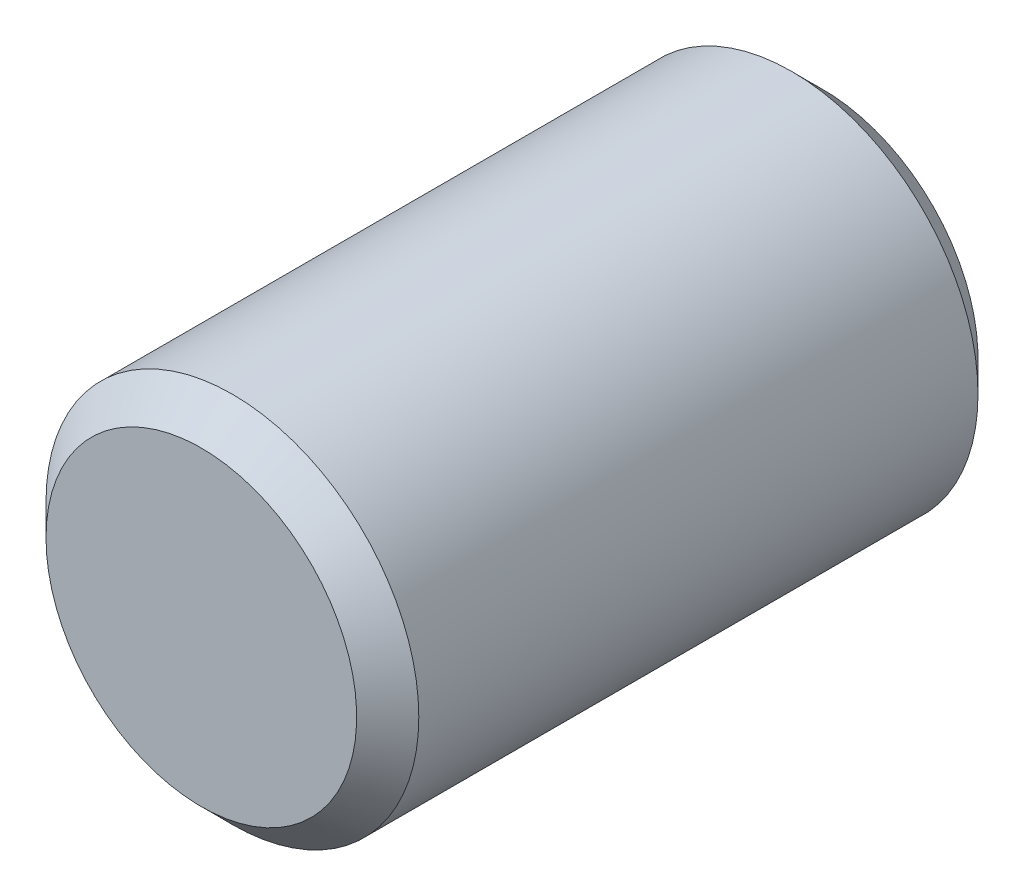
ISO-10303-21;
HEADER;
FILE_DESCRIPTION(('STEP AP214'),'2;1');
FILE_NAME('part.step','',(''),(''),'','','');
FILE_SCHEMA(('AUTOMOTIVE_DESIGN { 1 0 10303 214 1 1 1 1 }'));
ENDSEC;
DATA;
#1=APPLICATION_CONTEXT('core data for automotive mechanical design processes');
#2=APPLICATION_PROTOCOL_DEFINITION('international standard','automotive_design',2000,#1);
#3=PRODUCT_CONTEXT('',#1,'mechanical');
#4=PRODUCT('Part','Part','',(#3));
#5=PRODUCT_RELATED_PRODUCT_CATEGORY('part','',(#4));
#6=PRODUCT_DEFINITION_FORMATION('','',#4);
#7=PRODUCT_DEFINITION_CONTEXT('part definition',#1,'design');
#8=PRODUCT_DEFINITION('design','',#6,#7);
#9=PRODUCT_DEFINITION_SHAPE('','',#8);
#10=(LENGTH_UNIT() NAMED_UNIT(*) SI_UNIT(.MILLI.,.METRE.));
#11=(NAMED_UNIT(*) PLANE_ANGLE_UNIT() SI_UNIT($,.RADIAN.));
#12=(NAMED_UNIT(*) SI_UNIT($,.STERADIAN.) SOLID_ANGLE_UNIT());
#13=UNCERTAINTY_MEASURE_WITH_UNIT(LENGTH_MEASURE(1.E-05),#10,'distance_accuracy_value','');
#14=(GEOMETRIC_REPRESENTATION_CONTEXT(3) GLOBAL_UNCERTAINTY_ASSIGNED_CONTEXT((#13)) GLOBAL_UNIT_ASSIGNED_CONTEXT((#10,
#11,#12)) REPRESENTATION_CONTEXT('',''));
#15=CARTESIAN_POINT('',(0.,0.,0.));
#16=DIRECTION('',(0.,0.,1.));
#17=DIRECTION('',(1.,0.,0.));
#18=AXIS2_PLACEMENT_3D('',#15,#16,#17);
#19=CARTESIAN_POINT('',(0.,0.,0.));
#20=DIRECTION('',(0.,0.,-1.));
#21=DIRECTION('',(-1.,0.,0.));
#22=AXIS2_PLACEMENT_3D('',#19,#20,#21);
#23=PLANE('',#22);
#24=CARTESIAN_POINT('',(0.,0.,0.));
#25=DIRECTION('',(0.,0.,-1.));
#26=DIRECTION('',(-1.,0.,0.));
#27=AXIS2_PLACEMENT_3D('',#24,#25,#26);
#28=CIRCLE('',#27,2.5);
#29=CARTESIAN_POINT('',(-2.5,0.,0.));
#30=VERTEX_POINT('',#29);
#31=EDGE_CURVE('E11',#30,#30,#28,.T.);
#32=ORIENTED_EDGE('',*,*,#31,.T.);
#33=EDGE_LOOP('',(#32));
#34=FACE_BOUND('',#33,.T.);
#35=DIRECTION('',(0.866025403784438,-0.500000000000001,0.));
#36=VECTOR('',#35,1.);
#37=CARTESIAN_POINT('',(0.,1.72,0.));
#38=LINE('',#37,#36);
#39=CARTESIAN_POINT('',(0.,1.72,0.));
#40=VERTEX_POINT('',#39);
#41=CARTESIAN_POINT('',(1.48956369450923,0.86,0.));
#42=VERTEX_POINT('',#41);
#43=EDGE_CURVE('E501',#40,#42,#38,.T.);
#44=ORIENTED_EDGE('',*,*,#43,.F.);
#45=DIRECTION('',(-0.866025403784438,-0.500000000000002,0.));
#46=VECTOR('',#45,1.);
#47=CARTESIAN_POINT('',(0.,1.72,0.));
#48=LINE('',#47,#46);
#49=CARTESIAN_POINT('',(-1.48956369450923,0.859999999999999,0.));
#50=VERTEX_POINT('',#49);
#51=EDGE_CURVE('E446',#40,#50,#48,.T.);
#52=ORIENTED_EDGE('',*,*,#51,.T.);
#53=DIRECTION('',(0.,-1.,0.));
#54=VECTOR('',#53,1.);
#55=CARTESIAN_POINT('',(-1.48956369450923,0.859999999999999,0.));
#56=LINE('',#55,#54);
#57=CARTESIAN_POINT('',(-1.48956369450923,-0.86,0.));
#58=VERTEX_POINT('',#57);
#59=EDGE_CURVE('E484',#50,#58,#56,.T.);
#60=ORIENTED_EDGE('',*,*,#59,.T.);
#61=DIRECTION('',(0.866025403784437,-0.500000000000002,0.));
#62=VECTOR('',#61,1.);
#63=CARTESIAN_POINT('',(-1.48956369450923,-0.86,0.));
#64=LINE('',#63,#62);
#65=CARTESIAN_POINT('',(0.,-1.72,0.));
#66=VERTEX_POINT('',#65);
#67=EDGE_CURVE('E492',#58,#66,#64,.T.);
#68=ORIENTED_EDGE('',*,*,#67,.T.);
#69=DIRECTION('',(-0.866025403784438,-0.5,0.));
#70=VECTOR('',#69,1.);
#71=CARTESIAN_POINT('',(1.48956369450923,-0.859999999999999,0.));
#72=LINE('',#71,#70);
#73=CARTESIAN_POINT('',(1.48956369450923,-0.859999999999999,0.));
#74=VERTEX_POINT('',#73);
#75=EDGE_CURVE('E505',#74,#66,#72,.T.);
#76=ORIENTED_EDGE('',*,*,#75,.F.);
#77=DIRECTION('',(0.,-1.,0.));
#78=VECTOR('',#77,1.);
#79=CARTESIAN_POINT('',(1.48956369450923,0.86,0.));
#80=LINE('',#79,#78);
#81=EDGE_CURVE('E508',#42,#74,#80,.T.);
#82=ORIENTED_EDGE('',*,*,#81,.F.);
#83=EDGE_LOOP('',(#44,#52,#60,#68,#76,#82));
#84=FACE_BOUND('',#83,.T.);
#85=ADVANCED_FACE('F432',(#34,#84),#23,.T.);
#86=CARTESIAN_POINT('',(0.,0.,0.));
#87=DIRECTION('',(0.,0.,1.));
#88=DIRECTION('',(1.,0.,0.));
#89=AXIS2_PLACEMENT_3D('',#86,#87,#88);
#90=CONICAL_SURFACE('',#89,2.5,0.785398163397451);
#91=CARTESIAN_POINT('',(0.,0.,0.499999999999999));
#92=DIRECTION('',(0.,0.,-1.));
#93=DIRECTION('',(-1.,0.,0.));
#94=AXIS2_PLACEMENT_3D('',#91,#92,#93);
#95=CIRCLE('',#94,3.);
#96=CARTESIAN_POINT('',(-3.,0.,0.499999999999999));
#97=VERTEX_POINT('',#96);
#98=EDGE_CURVE('E439',#97,#97,#95,.T.);
#99=ORIENTED_EDGE('',*,*,#98,.T.);
#100=EDGE_LOOP('',(#99));
#101=FACE_BOUND('',#100,.T.);
#102=ORIENTED_EDGE('',*,*,#31,.F.);
#103=EDGE_LOOP('',(#102));
#104=FACE_BOUND('',#103,.T.);
#105=ADVANCED_FACE('F541',(#101,#104),#90,.T.);
#106=CARTESIAN_POINT('',(0.,0.,-10.));
#107=DIRECTION('',(0.,0.,-1.));
#108=DIRECTION('',(-1.,0.,0.));
#109=AXIS2_PLACEMENT_3D('',#106,#107,#108);
#110=CYLINDRICAL_SURFACE('',#109,3.);
#111=CARTESIAN_POINT('',(0.,0.,9.5));
#112=DIRECTION('',(0.,0.,-1.));
#113=DIRECTION('',(-1.,0.,0.));
#114=AXIS2_PLACEMENT_3D('',#111,#112,#113);
#115=CIRCLE('',#114,3.);
#116=CARTESIAN_POINT('',(-3.,0.,9.5));
#117=VERTEX_POINT('',#116);
#118=EDGE_CURVE('E536',#117,#117,#115,.T.);
#119=ORIENTED_EDGE('',*,*,#118,.T.);
#120=EDGE_LOOP('',(#119));
#121=FACE_BOUND('',#120,.T.);
#122=ORIENTED_EDGE('',*,*,#98,.F.);
#123=EDGE_LOOP('',(#122));
#124=FACE_BOUND('',#123,.T.);
#125=ADVANCED_FACE('F544',(#121,#124),#110,.T.);
#126=CARTESIAN_POINT('',(0.,0.,9.5));
#127=DIRECTION('',(0.,0.,-1.));
#128=DIRECTION('',(-1.,0.,0.));
#129=AXIS2_PLACEMENT_3D('',#126,#127,#128);
#130=CONICAL_SURFACE('',#129,3.,0.785398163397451);
#131=CARTESIAN_POINT('',(0.,0.,10.));
#132=DIRECTION('',(0.,0.,-1.));
#133=DIRECTION('',(-1.,0.,0.));
#134=AXIS2_PLACEMENT_3D('',#131,#132,#133);
#135=CIRCLE('',#134,2.5);
#136=CARTESIAN_POINT('',(-2.5,0.,10.));
#137=VERTEX_POINT('',#136);
#138=EDGE_CURVE('E496',#137,#137,#135,.T.);
#139=ORIENTED_EDGE('',*,*,#138,.T.);
#140=EDGE_LOOP('',(#139));
#141=FACE_BOUND('',#140,.T.);
#142=ORIENTED_EDGE('',*,*,#118,.F.);
#143=EDGE_LOOP('',(#142));
#144=FACE_BOUND('',#143,.T.);
#145=ADVANCED_FACE('F546',(#141,#144),#130,.T.);
#146=CARTESIAN_POINT('',(2.5,0.,10.));
#147=DIRECTION('',(0.,0.,1.));
#148=DIRECTION('',(1.,0.,0.));
#149=AXIS2_PLACEMENT_3D('',#146,#147,#148);
#150=PLANE('',#149);
#151=ORIENTED_EDGE('',*,*,#138,.F.);
#152=EDGE_LOOP('',(#151));
#153=FACE_BOUND('',#152,.T.);
#154=ADVANCED_FACE('F553',(#153),#150,.T.);
#155=CARTESIAN_POINT('',(0.,1.72,3.15));
#156=DIRECTION('',(0.500000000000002,-0.866025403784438,0.));
#157=DIRECTION('',(0.866025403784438,0.500000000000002,0.));
#158=AXIS2_PLACEMENT_3D('',#155,#156,#157);
#159=PLANE('',#158);
#160=ORIENTED_EDGE('',*,*,#51,.F.);
#161=DIRECTION('',(0.,0.,-1.));
#162=VECTOR('',#161,1.);
#163=CARTESIAN_POINT('',(0.,1.72,3.15));
#164=LINE('',#163,#162);
#165=CARTESIAN_POINT('',(0.,1.72,3.15));
#166=VERTEX_POINT('',#165);
#167=EDGE_CURVE('E450',#166,#40,#164,.T.);
#168=ORIENTED_EDGE('',*,*,#167,.F.);
#169=DIRECTION('',(-0.866025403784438,-0.500000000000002,0.));
#170=VECTOR('',#169,1.);
#171=CARTESIAN_POINT('',(0.,1.72,3.15));
#172=LINE('',#171,#170);
#173=CARTESIAN_POINT('',(-1.48956369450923,0.859999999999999,3.15));
#174=VERTEX_POINT('',#173);
#175=EDGE_CURVE('E495',#166,#174,#172,.T.);
#176=ORIENTED_EDGE('',*,*,#175,.T.);
#177=DIRECTION('',(0.,0.,-1.));
#178=VECTOR('',#177,1.);
#179=CARTESIAN_POINT('',(-1.48956369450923,0.859999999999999,3.15));
#180=LINE('',#179,#178);
#181=EDGE_CURVE('E486',#174,#50,#180,.T.);
#182=ORIENTED_EDGE('',*,*,#181,.T.);
#183=EDGE_LOOP('',(#160,#168,#176,#182));
#184=FACE_BOUND('',#183,.T.);
#185=ADVANCED_FACE('F494',(#184),#159,.T.);
#186=CARTESIAN_POINT('',(-1.48956369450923,0.859999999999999,3.15));
#187=DIRECTION('',(1.,0.,0.));
#188=DIRECTION('',(0.,1.,0.));
#189=AXIS2_PLACEMENT_3D('',#186,#187,#188);
#190=PLANE('',#189);
#191=ORIENTED_EDGE('',*,*,#59,.F.);
#192=ORIENTED_EDGE('',*,*,#181,.F.);
#193=DIRECTION('',(0.,-1.,0.));
#194=VECTOR('',#193,1.);
#195=CARTESIAN_POINT('',(-1.48956369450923,0.859999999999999,3.15));
#196=LINE('',#195,#194);
#197=CARTESIAN_POINT('',(-1.48956369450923,-0.86,3.15));
#198=VERTEX_POINT('',#197);
#199=EDGE_CURVE('E513',#174,#198,#196,.T.);
#200=ORIENTED_EDGE('',*,*,#199,.T.);
#201=DIRECTION('',(0.,0.,-1.));
#202=VECTOR('',#201,1.);
#203=CARTESIAN_POINT('',(-1.48956369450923,-0.86,3.15));
#204=LINE('',#203,#202);
#205=EDGE_CURVE('E488',#198,#58,#204,.T.);
#206=ORIENTED_EDGE('',*,*,#205,.T.);
#207=EDGE_LOOP('',(#191,#192,#200,#206));
#208=FACE_BOUND('',#207,.T.);
#209=ADVANCED_FACE('F485',(#208),#190,.T.);
#210=CARTESIAN_POINT('',(-1.48956369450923,-0.86,3.15));
#211=DIRECTION('',(0.500000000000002,0.866025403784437,0.));
#212=DIRECTION('',(-0.866025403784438,0.500000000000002,0.));
#213=AXIS2_PLACEMENT_3D('',#210,#211,#212);
#214=PLANE('',#213);
#215=ORIENTED_EDGE('',*,*,#67,.F.);
#216=ORIENTED_EDGE('',*,*,#205,.F.);
#217=DIRECTION('',(0.866025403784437,-0.500000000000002,0.));
#218=VECTOR('',#217,1.);
#219=CARTESIAN_POINT('',(-1.48956369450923,-0.86,3.15));
#220=LINE('',#219,#218);
#221=CARTESIAN_POINT('',(0.,-1.72,3.15));
#222=VERTEX_POINT('',#221);
#223=EDGE_CURVE('E515',#198,#222,#220,.T.);
#224=ORIENTED_EDGE('',*,*,#223,.T.);
#225=DIRECTION('',(0.,0.,-1.));
#226=VECTOR('',#225,1.);
#227=CARTESIAN_POINT('',(0.,-1.72,3.15));
#228=LINE('',#227,#226);
#229=EDGE_CURVE('E531',#222,#66,#228,.T.);
#230=ORIENTED_EDGE('',*,*,#229,.T.);
#231=EDGE_LOOP('',(#215,#216,#224,#230));
#232=FACE_BOUND('',#231,.T.);
#233=ADVANCED_FACE('F576',(#232),#214,.T.);
#234=CARTESIAN_POINT('',(1.48956369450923,-0.859999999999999,3.15));
#235=DIRECTION('',(0.5,-0.866025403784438,0.));
#236=DIRECTION('',(0.866025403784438,0.5,0.));
#237=AXIS2_PLACEMENT_3D('',#234,#235,#236);
#238=PLANE('',#237);
#239=ORIENTED_EDGE('',*,*,#75,.T.);
#240=ORIENTED_EDGE('',*,*,#229,.F.);
#241=DIRECTION('',(-0.866025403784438,-0.5,0.));
#242=VECTOR('',#241,1.);
#243=CARTESIAN_POINT('',(1.48956369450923,-0.859999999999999,3.15));
#244=LINE('',#243,#242);
#245=CARTESIAN_POINT('',(1.48956369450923,-0.859999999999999,3.15));
#246=VERTEX_POINT('',#245);
#247=EDGE_CURVE('E517',#246,#222,#244,.T.);
#248=ORIENTED_EDGE('',*,*,#247,.F.);
#249=DIRECTION('',(0.,0.,-1.));
#250=VECTOR('',#249,1.);
#251=CARTESIAN_POINT('',(1.48956369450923,-0.859999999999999,3.15));
#252=LINE('',#251,#250);
#253=EDGE_CURVE('E529',#246,#74,#252,.T.);
#254=ORIENTED_EDGE('',*,*,#253,.T.);
#255=EDGE_LOOP('',(#239,#240,#248,#254));
#256=FACE_BOUND('',#255,.T.);
#257=ADVANCED_FACE('F583',(#256),#238,.F.);
#258=CARTESIAN_POINT('',(1.48956369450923,0.86,3.15));
#259=DIRECTION('',(1.,0.,0.));
#260=DIRECTION('',(0.,0.,-1.));
#261=AXIS2_PLACEMENT_3D('',#258,#259,#260);
#262=PLANE('',#261);
#263=ORIENTED_EDGE('',*,*,#81,.T.);
#264=ORIENTED_EDGE('',*,*,#253,.F.);
#265=DIRECTION('',(0.,-1.,0.));
#266=VECTOR('',#265,1.);
#267=CARTESIAN_POINT('',(1.48956369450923,0.86,3.15));
#268=LINE('',#267,#266);
#269=CARTESIAN_POINT('',(1.48956369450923,0.86,3.15));
#270=VERTEX_POINT('',#269);
#271=EDGE_CURVE('E520',#270,#246,#268,.T.);
#272=ORIENTED_EDGE('',*,*,#271,.F.);
#273=DIRECTION('',(0.,0.,-1.));
#274=VECTOR('',#273,1.);
#275=CARTESIAN_POINT('',(1.48956369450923,0.86,3.15));
#276=LINE('',#275,#274);
#277=EDGE_CURVE('E527',#270,#42,#276,.T.);
#278=ORIENTED_EDGE('',*,*,#277,.T.);
#279=EDGE_LOOP('',(#263,#264,#272,#278));
#280=FACE_BOUND('',#279,.T.);
#281=ADVANCED_FACE('F591',(#280),#262,.F.);
#282=CARTESIAN_POINT('',(0.,1.72,3.15));
#283=DIRECTION('',(0.500000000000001,0.866025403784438,0.));
#284=DIRECTION('',(-0.866025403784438,0.500000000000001,0.));
#285=AXIS2_PLACEMENT_3D('',#282,#283,#284);
#286=PLANE('',#285);
#287=ORIENTED_EDGE('',*,*,#43,.T.);
#288=ORIENTED_EDGE('',*,*,#277,.F.);
#289=DIRECTION('',(0.866025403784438,-0.500000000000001,0.));
#290=VECTOR('',#289,1.);
#291=CARTESIAN_POINT('',(0.,1.72,3.15));
#292=LINE('',#291,#290);
#293=EDGE_CURVE('E523',#166,#270,#292,.T.);
#294=ORIENTED_EDGE('',*,*,#293,.F.);
#295=ORIENTED_EDGE('',*,*,#167,.T.);
#296=EDGE_LOOP('',(#287,#288,#294,#295));
#297=FACE_BOUND('',#296,.T.);
#298=ADVANCED_FACE('F599',(#297),#286,.F.);
#299=CARTESIAN_POINT('',(-2.97912738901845,0.,3.15));
#300=DIRECTION('',(0.,0.,1.));
#301=DIRECTION('',(1.,0.,0.));
#302=AXIS2_PLACEMENT_3D('',#299,#300,#301);
#303=PLANE('',#302);
#304=ORIENTED_EDGE('',*,*,#175,.F.);
#305=ORIENTED_EDGE('',*,*,#293,.T.);
#306=ORIENTED_EDGE('',*,*,#271,.T.);
#307=ORIENTED_EDGE('',*,*,#247,.T.);
#308=ORIENTED_EDGE('',*,*,#223,.F.);
#309=ORIENTED_EDGE('',*,*,#199,.F.);
#310=EDGE_LOOP('',(#304,#305,#306,#307,#308,#309));
#311=FACE_BOUND('',#310,.T.);
#312=ADVANCED_FACE('F607',(#311),#303,.F.);
#313=CLOSED_SHELL('',(#85,#105,#125,#145,#154,#185,#209,#233,#257,#281,#298,#312));
#314=MANIFOLD_SOLID_BREP('B2',#313);
#315=ADVANCED_BREP_SHAPE_REPRESENTATION('',(#18,#314),#14);
#316=SHAPE_DEFINITION_REPRESENTATION(#9,#315);
ENDSEC;
END-ISO-10303-21;
